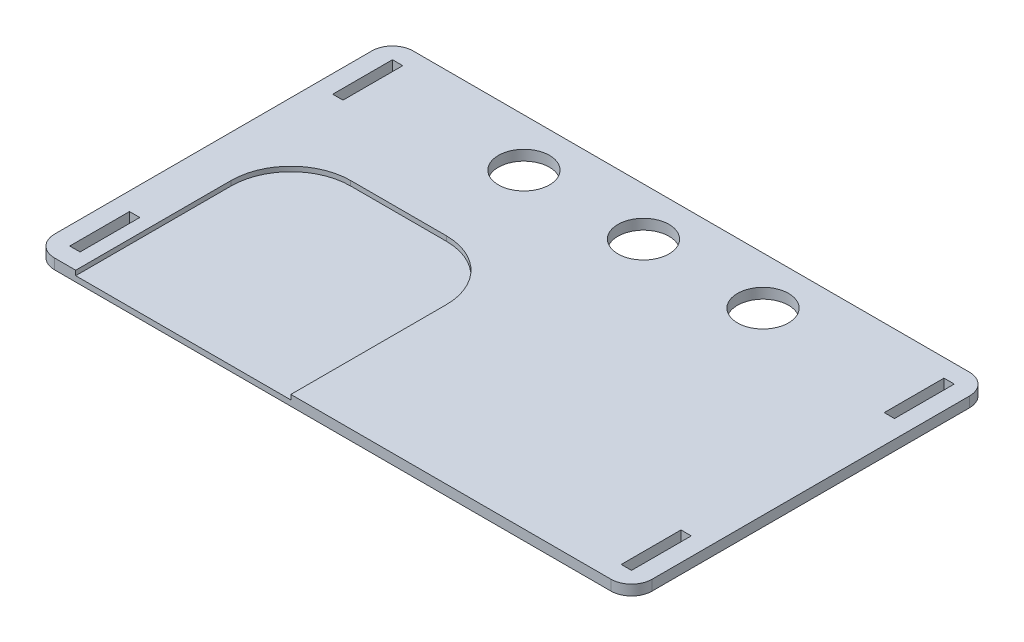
from build123d import *

# Parameters (mm, degrees)
SKETCH1_W                          = 1000
SKETCH1_H                          = 600
TABLE_TOP_DEPTH                    = 17.25
TABLE_FILLETS_R                    = 34.5
PEEL_START                         = 17.25
SKETCH2_W                          = 360
SKETCH2_H                          = 360
PEEL_SLIT_DEPTH                    = 8
PEEL_FILLET_R                      = 100
LEG_START                          = 17.25
SKETCH3_W                          = 17.25
SKETCH3_H                          = 100
LEG_SLOTS_DEPTH                    = 601.60029142
LEG_SLOTS_MIRROR_2_COPY_1_SKETCH_W = 17.25
LEG_SLOTS_MIRROR_2_COPY_1_SKETCH_H = 100
LEG_SLOTS_MIRROR_2_COPY_1_DEPTH    = 601.60029142
CUT_EXTRUDE1_START                 = 17.25
SKETCH4_R                          = 42.75
CUT_EXTRUDE1_DEPTH                 = 601.60029142
LPATTERN1_COUNT                    = 2
LPATTERN1_PITCH                    = 200
LPATTERN1_COL_COUNT                = 2
LPATTERN1_COL_PITCH                = 200


with BuildPart() as part:
    # Sketch1 → Table Top (new body)
    with BuildSketch(Plane(origin=(0, 0, 0), x_dir=(1, 0, 0), z_dir=(0, 1, 0))):
        Rectangle(SKETCH1_W, SKETCH1_H)
    extrude(amount=TABLE_TOP_DEPTH)

    # Table Fillets
    table_fillets_edges = [part.edges().sort_by_distance(p)[0] for p in [
        (500, 8.625, 300),
        (-500, 8.625, 300),
        (-500, 8.625, -300),
        (500, 8.625, -300),
    ]]
    fillet(table_fillets_edges, radius=TABLE_FILLETS_R)

    # Sketch2 → Peel Slit (cut)
    with BuildSketch(Plane(origin=(0, 0, 0), x_dir=(1, 0, 0), z_dir=(0, 1, 0)).offset(PEEL_START)):
        with Locations((-250, -120)):
            Rectangle(SKETCH2_W, SKETCH2_H)
    extrude(amount=-PEEL_SLIT_DEPTH, mode=Mode.SUBTRACT)

    # Peel Fillet
    peel_fillet_edges = [part.edges().sort_by_distance(p)[0] for p in [
        (-430, 13.25, -60),
        (-70, 13.25, -60),
    ]]
    fillet(peel_fillet_edges, radius=PEEL_FILLET_R)

    # Sketch3 → Leg Slots (cut, through all)
    with BuildSketch(Plane(origin=(0, 0, 0), x_dir=(1, 0, 0), z_dir=(0, 1, 0)).offset(LEG_START)):
        with Locations((-461.375, -220)):
            Rectangle(SKETCH3_W, SKETCH3_H)
    leg_slots = extrude(amount=-LEG_SLOTS_DEPTH, mode=Mode.SUBTRACT)

    # Leg Slots Mirror 1: Leg Slots across plane
    add(leg_slots.mirror(Plane.XY), mode=Mode.SUBTRACT)

    # Leg Slots Mirror 2: Leg Slots across plane
    add(leg_slots.mirror(Plane(origin=(0, 0, 0), x_dir=(0, 0, 1), z_dir=(1, 0, 0))), mode=Mode.SUBTRACT)

    # Leg Slots Mirror 2 copy 1 sketch → Leg Slots Mirror 2 copy 1 (cut, through all)
    with BuildSketch(Plane(origin=(0, 0, 0), x_dir=(-1, 0, 0), z_dir=(0, 1, 0)).offset(LEG_START)):
        with Locations((-461.375, -220)):
            Rectangle(LEG_SLOTS_MIRROR_2_COPY_1_SKETCH_W, LEG_SLOTS_MIRROR_2_COPY_1_SKETCH_H)
    extrude(amount=-LEG_SLOTS_MIRROR_2_COPY_1_DEPTH, mode=Mode.SUBTRACT)

    # Sketch4 → Cut-Extrude1 (cut, through all)
    with BuildSketch(Plane(origin=(0, 0, 0), x_dir=(1, 0, 0), z_dir=(0, 1, 0)).offset(CUT_EXTRUDE1_START)):
        with Locations(Location((0, 220, 0), (0, 0, 90))):
            Circle(SKETCH4_R)
    cut_extrude1 = extrude(amount=-CUT_EXTRUDE1_DEPTH, mode=Mode.SUBTRACT)

    # LPattern1: Cut-Extrude1 ×2
    with Locations(*[(i * LPATTERN1_PITCH, 0, 0) for i in range(1, LPATTERN1_COUNT)]):
        add(cut_extrude1, mode=Mode.SUBTRACT)

    # LPattern1 col: Cut-Extrude1 ×2
    with Locations(*[(-i * LPATTERN1_COL_PITCH, 0, 0) for i in range(1, LPATTERN1_COL_COUNT)]):
        add(cut_extrude1, mode=Mode.SUBTRACT)


solid = part.part
